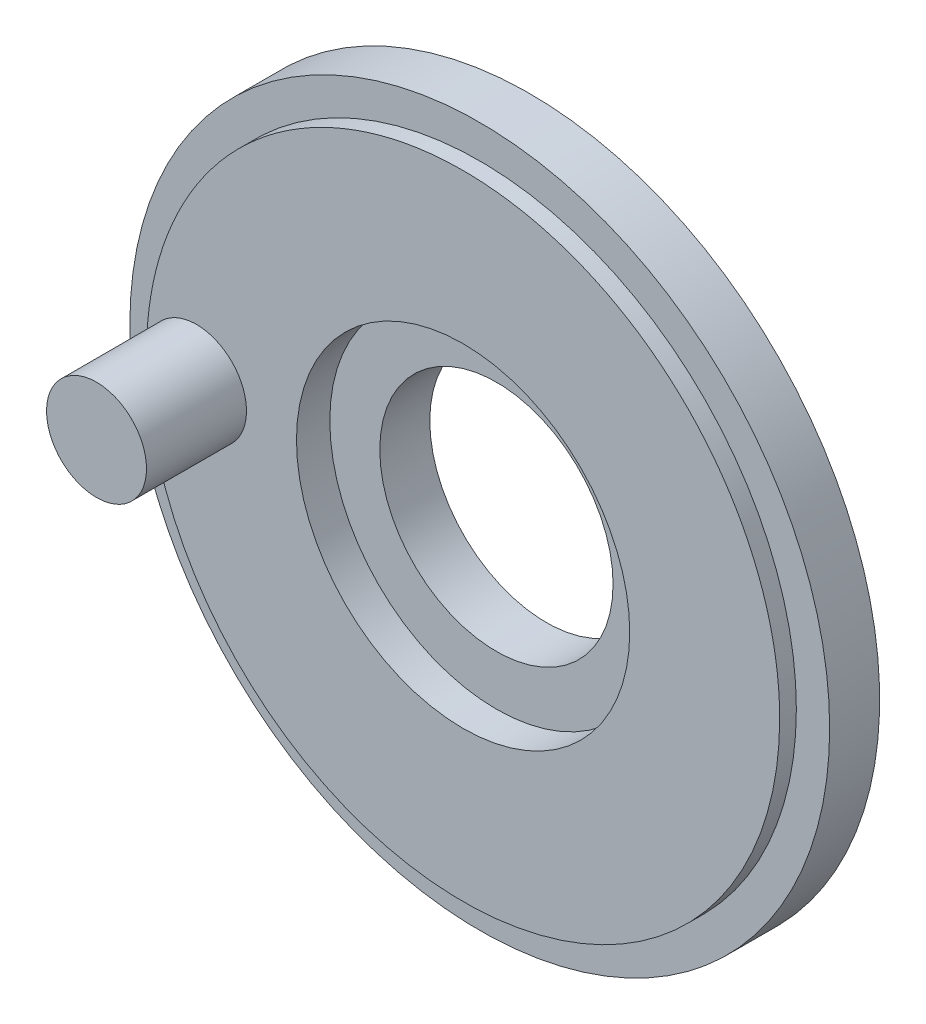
ISO-10303-21;
HEADER;
FILE_DESCRIPTION(('STEP AP214'),'2;1');
FILE_NAME('part.step','',(''),(''),'','','');
FILE_SCHEMA(('AUTOMOTIVE_DESIGN { 1 0 10303 214 1 1 1 1 }'));
ENDSEC;
DATA;
#1=APPLICATION_CONTEXT('core data for automotive mechanical design processes');
#2=APPLICATION_PROTOCOL_DEFINITION('international standard','automotive_design',2000,#1);
#3=PRODUCT_CONTEXT('',#1,'mechanical');
#4=PRODUCT('Part','Part','',(#3));
#5=PRODUCT_RELATED_PRODUCT_CATEGORY('part','',(#4));
#6=PRODUCT_DEFINITION_FORMATION('','',#4);
#7=PRODUCT_DEFINITION_CONTEXT('part definition',#1,'design');
#8=PRODUCT_DEFINITION('design','',#6,#7);
#9=PRODUCT_DEFINITION_SHAPE('','',#8);
#10=(LENGTH_UNIT() NAMED_UNIT(*) SI_UNIT(.MILLI.,.METRE.));
#11=(NAMED_UNIT(*) PLANE_ANGLE_UNIT() SI_UNIT($,.RADIAN.));
#12=(NAMED_UNIT(*) SI_UNIT($,.STERADIAN.) SOLID_ANGLE_UNIT());
#13=UNCERTAINTY_MEASURE_WITH_UNIT(LENGTH_MEASURE(1.E-05),#10,'distance_accuracy_value','');
#14=(GEOMETRIC_REPRESENTATION_CONTEXT(3) GLOBAL_UNCERTAINTY_ASSIGNED_CONTEXT((#13)) GLOBAL_UNIT_ASSIGNED_CONTEXT((#10,
#11,#12)) REPRESENTATION_CONTEXT('',''));
#15=CARTESIAN_POINT('',(0.,0.,0.));
#16=DIRECTION('',(0.,0.,1.));
#17=DIRECTION('',(1.,0.,0.));
#18=AXIS2_PLACEMENT_3D('',#15,#16,#17);
#19=CARTESIAN_POINT('',(0.,0.,2.5));
#20=DIRECTION('',(0.,0.,-1.));
#21=DIRECTION('',(-1.,0.,0.));
#22=AXIS2_PLACEMENT_3D('',#19,#20,#21);
#23=CYLINDRICAL_SURFACE('',#22,10.5);
#24=CARTESIAN_POINT('',(0.,0.,2.));
#25=DIRECTION('',(0.,0.,1.));
#26=DIRECTION('',(1.,0.,0.));
#27=AXIS2_PLACEMENT_3D('',#24,#25,#26);
#28=CIRCLE('',#27,10.5);
#29=CARTESIAN_POINT('',(10.5,0.,2.));
#30=VERTEX_POINT('',#29);
#31=EDGE_CURVE('E39',#30,#30,#28,.T.);
#32=ORIENTED_EDGE('',*,*,#31,.F.);
#33=EDGE_LOOP('',(#32));
#34=FACE_BOUND('',#33,.T.);
#35=CARTESIAN_POINT('',(0.,0.,0.5));
#36=DIRECTION('',(0.,0.,-1.));
#37=DIRECTION('',(-1.,0.,0.));
#38=AXIS2_PLACEMENT_3D('',#35,#36,#37);
#39=CIRCLE('',#38,10.5);
#40=CARTESIAN_POINT('',(-10.5,0.,0.5));
#41=VERTEX_POINT('',#40);
#42=EDGE_CURVE('E68',#41,#41,#39,.T.);
#43=ORIENTED_EDGE('',*,*,#42,.F.);
#44=EDGE_LOOP('',(#43));
#45=FACE_BOUND('',#44,.T.);
#46=ADVANCED_FACE('F32',(#34,#45),#23,.T.);
#47=CARTESIAN_POINT('',(0.,0.,1.5));
#48=DIRECTION('',(0.,0.,-1.));
#49=DIRECTION('',(-1.,0.,0.));
#50=AXIS2_PLACEMENT_3D('',#47,#48,#49);
#51=CYLINDRICAL_SURFACE('',#50,8.5);
#52=CARTESIAN_POINT('',(0.,0.,1.5));
#53=DIRECTION('',(0.,0.,-1.));
#54=DIRECTION('',(-1.,0.,0.));
#55=AXIS2_PLACEMENT_3D('',#52,#53,#54);
#56=CIRCLE('',#55,8.5);
#57=CARTESIAN_POINT('',(-8.5,0.,1.5));
#58=VERTEX_POINT('',#57);
#59=EDGE_CURVE('E79',#58,#58,#56,.T.);
#60=ORIENTED_EDGE('',*,*,#59,.F.);
#61=EDGE_LOOP('',(#60));
#62=FACE_BOUND('',#61,.T.);
#63=CARTESIAN_POINT('',(0.,0.,0.5));
#64=DIRECTION('',(0.,0.,-1.));
#65=DIRECTION('',(-1.,0.,0.));
#66=AXIS2_PLACEMENT_3D('',#63,#64,#65);
#67=CIRCLE('',#66,8.5);
#68=CARTESIAN_POINT('',(-8.5,0.,0.5));
#69=VERTEX_POINT('',#68);
#70=EDGE_CURVE('E35',#69,#69,#67,.F.);
#71=ORIENTED_EDGE('',*,*,#70,.F.);
#72=EDGE_LOOP('',(#71));
#73=FACE_BOUND('',#72,.T.);
#74=ADVANCED_FACE('F65',(#62,#73),#51,.F.);
#75=CARTESIAN_POINT('',(0.,0.,0.));
#76=DIRECTION('',(0.,0.,1.));
#77=DIRECTION('',(1.,0.,0.));
#78=AXIS2_PLACEMENT_3D('',#75,#76,#77);
#79=PLANE('',#78);
#80=CARTESIAN_POINT('',(0.,0.,0.));
#81=DIRECTION('',(0.,0.,1.));
#82=DIRECTION('',(1.,0.,0.));
#83=AXIS2_PLACEMENT_3D('',#80,#81,#82);
#84=CIRCLE('',#83,3.5);
#85=CARTESIAN_POINT('',(3.5,0.,0.));
#86=VERTEX_POINT('',#85);
#87=EDGE_CURVE('E11',#86,#86,#84,.T.);
#88=ORIENTED_EDGE('',*,*,#87,.T.);
#89=EDGE_LOOP('',(#88));
#90=FACE_BOUND('',#89,.T.);
#91=CARTESIAN_POINT('',(0.,0.,0.));
#92=DIRECTION('',(0.,0.,-1.));
#93=DIRECTION('',(-1.,0.,0.));
#94=AXIS2_PLACEMENT_3D('',#91,#92,#93);
#95=CIRCLE('',#94,5.5);
#96=CARTESIAN_POINT('',(-5.5,0.,0.));
#97=VERTEX_POINT('',#96);
#98=EDGE_CURVE('E70',#97,#97,#95,.T.);
#99=ORIENTED_EDGE('',*,*,#98,.T.);
#100=EDGE_LOOP('',(#99));
#101=FACE_BOUND('',#100,.T.);
#102=ADVANCED_FACE('F117',(#90,#101),#79,.F.);
#103=CARTESIAN_POINT('',(0.,0.,2.5));
#104=DIRECTION('',(0.,0.,-1.));
#105=DIRECTION('',(-1.,0.,0.));
#106=AXIS2_PLACEMENT_3D('',#103,#104,#105);
#107=CYLINDRICAL_SURFACE('',#106,3.5);
#108=ORIENTED_EDGE('',*,*,#87,.F.);
#109=EDGE_LOOP('',(#108));
#110=FACE_BOUND('',#109,.T.);
#111=CARTESIAN_POINT('',(0.,0.,1.5));
#112=DIRECTION('',(0.,0.,1.));
#113=DIRECTION('',(1.,0.,0.));
#114=AXIS2_PLACEMENT_3D('',#111,#112,#113);
#115=CIRCLE('',#114,3.5);
#116=CARTESIAN_POINT('',(3.5,0.,1.5));
#117=VERTEX_POINT('',#116);
#118=EDGE_CURVE('E49',#117,#117,#115,.T.);
#119=ORIENTED_EDGE('',*,*,#118,.T.);
#120=EDGE_LOOP('',(#119));
#121=FACE_BOUND('',#120,.T.);
#122=ADVANCED_FACE('F114',(#110,#121),#107,.F.);
#123=CARTESIAN_POINT('',(0.,0.,2.5));
#124=DIRECTION('',(0.,0.,1.));
#125=DIRECTION('',(1.,0.,0.));
#126=AXIS2_PLACEMENT_3D('',#123,#124,#125);
#127=PLANE('',#126);
#128=CARTESIAN_POINT('',(0.,0.,2.5));
#129=DIRECTION('',(0.,0.,1.));
#130=DIRECTION('',(1.,0.,0.));
#131=AXIS2_PLACEMENT_3D('',#128,#129,#130);
#132=CIRCLE('',#131,5.);
#133=CARTESIAN_POINT('',(5.,0.,2.5));
#134=VERTEX_POINT('',#133);
#135=EDGE_CURVE('E87',#134,#134,#132,.T.);
#136=ORIENTED_EDGE('',*,*,#135,.F.);
#137=EDGE_LOOP('',(#136));
#138=FACE_BOUND('',#137,.T.);
#139=CARTESIAN_POINT('',(0.,0.,2.5));
#140=DIRECTION('',(0.,0.,1.));
#141=DIRECTION('',(1.,0.,0.));
#142=AXIS2_PLACEMENT_3D('',#139,#140,#141);
#143=CIRCLE('',#142,9.5);
#144=CARTESIAN_POINT('',(-9.5,0.,2.5));
#145=VERTEX_POINT('',#144);
#146=EDGE_CURVE('E44',#145,#145,#143,.T.);
#147=ORIENTED_EDGE('',*,*,#146,.T.);
#148=CARTESIAN_POINT('',(-8.,0.,2.5));
#149=DIRECTION('',(0.,0.,1.));
#150=DIRECTION('',(1.,0.,0.));
#151=AXIS2_PLACEMENT_3D('',#148,#149,#150);
#152=CIRCLE('',#151,1.5);
#153=EDGE_CURVE('E82',#145,#145,#152,.T.);
#154=ORIENTED_EDGE('',*,*,#153,.F.);
#155=EDGE_LOOP('',(#147,#154));
#156=FACE_BOUND('',#155,.T.);
#157=ADVANCED_FACE('F112',(#138,#156),#127,.T.);
#158=CARTESIAN_POINT('',(0.,0.,2.));
#159=DIRECTION('',(0.,0.,1.));
#160=DIRECTION('',(1.,0.,0.));
#161=AXIS2_PLACEMENT_3D('',#158,#159,#160);
#162=PLANE('',#161);
#163=CARTESIAN_POINT('',(0.,0.,2.));
#164=DIRECTION('',(0.,0.,1.));
#165=DIRECTION('',(1.,0.,0.));
#166=AXIS2_PLACEMENT_3D('',#163,#164,#165);
#167=CIRCLE('',#166,9.5);
#168=CARTESIAN_POINT('',(9.5,0.,2.));
#169=VERTEX_POINT('',#168);
#170=EDGE_CURVE('E48',#169,#169,#167,.T.);
#171=ORIENTED_EDGE('',*,*,#170,.F.);
#172=EDGE_LOOP('',(#171));
#173=FACE_BOUND('',#172,.T.);
#174=ORIENTED_EDGE('',*,*,#31,.T.);
#175=EDGE_LOOP('',(#174));
#176=FACE_BOUND('',#175,.T.);
#177=ADVANCED_FACE('F61',(#173,#176),#162,.T.);
#178=CARTESIAN_POINT('',(0.,0.,2.));
#179=DIRECTION('',(0.,0.,1.));
#180=DIRECTION('',(1.,0.,0.));
#181=AXIS2_PLACEMENT_3D('',#178,#179,#180);
#182=CYLINDRICAL_SURFACE('',#181,9.5);
#183=ORIENTED_EDGE('',*,*,#170,.T.);
#184=EDGE_LOOP('',(#183));
#185=FACE_BOUND('',#184,.T.);
#186=ORIENTED_EDGE('',*,*,#146,.F.);
#187=EDGE_LOOP('',(#186));
#188=FACE_BOUND('',#187,.T.);
#189=ADVANCED_FACE('F45',(#185,#188),#182,.T.);
#190=CARTESIAN_POINT('',(0.,0.,1.5));
#191=DIRECTION('',(0.,0.,1.));
#192=DIRECTION('',(1.,0.,0.));
#193=AXIS2_PLACEMENT_3D('',#190,#191,#192);
#194=CYLINDRICAL_SURFACE('',#193,5.);
#195=CARTESIAN_POINT('',(0.,0.,1.5));
#196=DIRECTION('',(0.,0.,1.));
#197=DIRECTION('',(1.,0.,0.));
#198=AXIS2_PLACEMENT_3D('',#195,#196,#197);
#199=CIRCLE('',#198,5.);
#200=CARTESIAN_POINT('',(5.,0.,1.5));
#201=VERTEX_POINT('',#200);
#202=EDGE_CURVE('E54',#201,#201,#199,.T.);
#203=ORIENTED_EDGE('',*,*,#202,.F.);
#204=EDGE_LOOP('',(#203));
#205=FACE_BOUND('',#204,.T.);
#206=ORIENTED_EDGE('',*,*,#135,.T.);
#207=EDGE_LOOP('',(#206));
#208=FACE_BOUND('',#207,.T.);
#209=ADVANCED_FACE('F96',(#205,#208),#194,.F.);
#210=CARTESIAN_POINT('',(0.,0.,1.5));
#211=DIRECTION('',(0.,0.,1.));
#212=DIRECTION('',(1.,0.,0.));
#213=AXIS2_PLACEMENT_3D('',#210,#211,#212);
#214=PLANE('',#213);
#215=ORIENTED_EDGE('',*,*,#118,.F.);
#216=EDGE_LOOP('',(#215));
#217=FACE_BOUND('',#216,.T.);
#218=ORIENTED_EDGE('',*,*,#202,.T.);
#219=EDGE_LOOP('',(#218));
#220=FACE_BOUND('',#219,.T.);
#221=ADVANCED_FACE('F94',(#217,#220),#214,.T.);
#222=CARTESIAN_POINT('',(-8.,0.,5.5));
#223=DIRECTION('',(0.,0.,-1.));
#224=DIRECTION('',(-1.,0.,0.));
#225=AXIS2_PLACEMENT_3D('',#222,#223,#224);
#226=CYLINDRICAL_SURFACE('',#225,1.5);
#227=CARTESIAN_POINT('',(-8.,0.,5.5));
#228=DIRECTION('',(0.,0.,1.));
#229=DIRECTION('',(1.,0.,0.));
#230=AXIS2_PLACEMENT_3D('',#227,#228,#229);
#231=CIRCLE('',#230,1.5);
#232=CARTESIAN_POINT('',(-6.5,0.,5.5));
#233=VERTEX_POINT('',#232);
#234=EDGE_CURVE('E85',#233,#233,#231,.T.);
#235=ORIENTED_EDGE('',*,*,#234,.F.);
#236=EDGE_LOOP('',(#235));
#237=FACE_BOUND('',#236,.T.);
#238=ORIENTED_EDGE('',*,*,#153,.T.);
#239=EDGE_LOOP('',(#238));
#240=FACE_BOUND('',#239,.T.);
#241=ADVANCED_FACE('F103',(#237,#240),#226,.T.);
#242=CARTESIAN_POINT('',(-8.,0.,5.5));
#243=DIRECTION('',(0.,0.,1.));
#244=DIRECTION('',(1.,0.,0.));
#245=AXIS2_PLACEMENT_3D('',#242,#243,#244);
#246=PLANE('',#245);
#247=ORIENTED_EDGE('',*,*,#234,.T.);
#248=EDGE_LOOP('',(#247));
#249=FACE_BOUND('',#248,.T.);
#250=ADVANCED_FACE('F146',(#249),#246,.T.);
#251=CARTESIAN_POINT('',(0.,0.,1.5));
#252=DIRECTION('',(0.,0.,-1.));
#253=DIRECTION('',(-1.,0.,0.));
#254=AXIS2_PLACEMENT_3D('',#251,#252,#253);
#255=PLANE('',#254);
#256=CARTESIAN_POINT('',(0.,0.,1.5));
#257=DIRECTION('',(0.,0.,-1.));
#258=DIRECTION('',(-1.,0.,0.));
#259=AXIS2_PLACEMENT_3D('',#256,#257,#258);
#260=CIRCLE('',#259,5.5);
#261=CARTESIAN_POINT('',(-5.5,0.,1.5));
#262=VERTEX_POINT('',#261);
#263=EDGE_CURVE('E73',#262,#262,#260,.T.);
#264=ORIENTED_EDGE('',*,*,#263,.F.);
#265=EDGE_LOOP('',(#264));
#266=FACE_BOUND('',#265,.T.);
#267=ORIENTED_EDGE('',*,*,#59,.T.);
#268=EDGE_LOOP('',(#267));
#269=FACE_BOUND('',#268,.T.);
#270=ADVANCED_FACE('F156',(#266,#269),#255,.T.);
#271=CARTESIAN_POINT('',(0.,0.,1.5));
#272=DIRECTION('',(0.,0.,-1.));
#273=DIRECTION('',(-1.,0.,0.));
#274=AXIS2_PLACEMENT_3D('',#271,#272,#273);
#275=CYLINDRICAL_SURFACE('',#274,5.5);
#276=ORIENTED_EDGE('',*,*,#263,.T.);
#277=EDGE_LOOP('',(#276));
#278=FACE_BOUND('',#277,.T.);
#279=ORIENTED_EDGE('',*,*,#98,.F.);
#280=EDGE_LOOP('',(#279));
#281=FACE_BOUND('',#280,.T.);
#282=ADVANCED_FACE('F173',(#278,#281),#275,.T.);
#283=CARTESIAN_POINT('',(0.,0.,0.5));
#284=DIRECTION('',(0.,0.,-1.));
#285=DIRECTION('',(-1.,0.,0.));
#286=AXIS2_PLACEMENT_3D('',#283,#284,#285);
#287=PLANE('',#286);
#288=ORIENTED_EDGE('',*,*,#70,.T.);
#289=EDGE_LOOP('',(#288));
#290=FACE_BOUND('',#289,.T.);
#291=ORIENTED_EDGE('',*,*,#42,.T.);
#292=EDGE_LOOP('',(#291));
#293=FACE_BOUND('',#292,.T.);
#294=ADVANCED_FACE('F183',(#290,#293),#287,.T.);
#295=CLOSED_SHELL('',(#46,#74,#102,#122,#157,#177,#189,#209,#221,#241,#250,#270,#282,#294));
#296=MANIFOLD_SOLID_BREP('B2',#295);
#297=ADVANCED_BREP_SHAPE_REPRESENTATION('',(#18,#296),#14);
#298=SHAPE_DEFINITION_REPRESENTATION(#9,#297);
ENDSEC;
END-ISO-10303-21;
